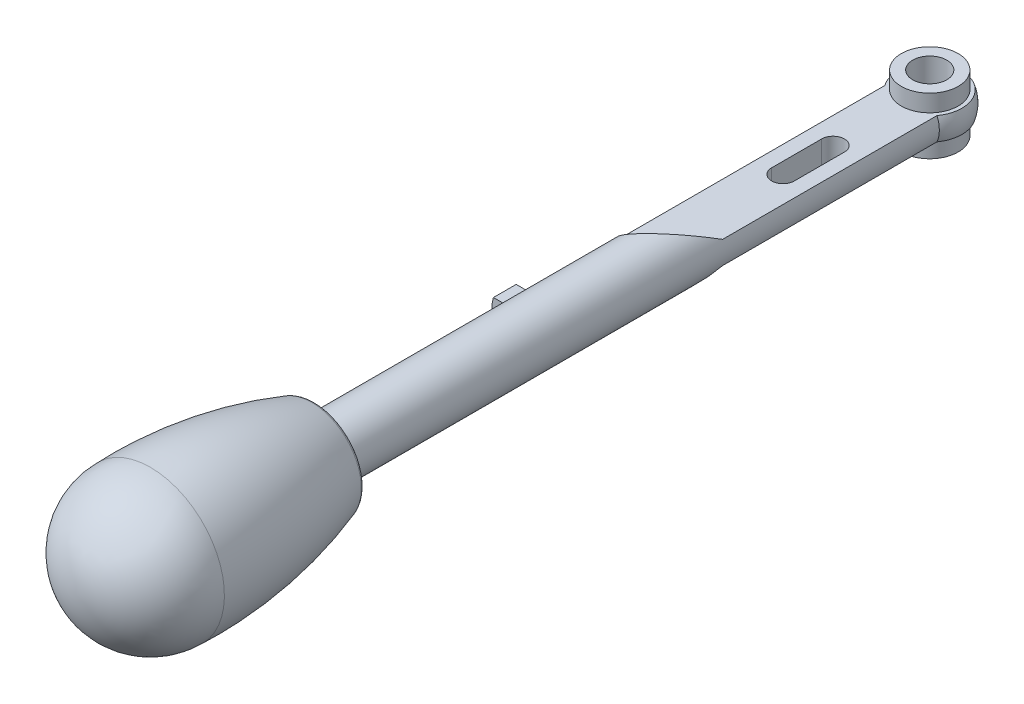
ISO-10303-21;
HEADER;
FILE_DESCRIPTION(('STEP AP214'),'2;1');
FILE_NAME('part.step','',(''),(''),'','','');
FILE_SCHEMA(('AUTOMOTIVE_DESIGN { 1 0 10303 214 1 1 1 1 }'));
ENDSEC;
DATA;
#1=APPLICATION_CONTEXT('core data for automotive mechanical design processes');
#2=APPLICATION_PROTOCOL_DEFINITION('international standard','automotive_design',2000,#1);
#3=PRODUCT_CONTEXT('',#1,'mechanical');
#4=PRODUCT('Part','Part','',(#3));
#5=PRODUCT_RELATED_PRODUCT_CATEGORY('part','',(#4));
#6=PRODUCT_DEFINITION_FORMATION('','',#4);
#7=PRODUCT_DEFINITION_CONTEXT('part definition',#1,'design');
#8=PRODUCT_DEFINITION('design','',#6,#7);
#9=PRODUCT_DEFINITION_SHAPE('','',#8);
#10=(LENGTH_UNIT() NAMED_UNIT(*) SI_UNIT(.MILLI.,.METRE.));
#11=(NAMED_UNIT(*) PLANE_ANGLE_UNIT() SI_UNIT($,.RADIAN.));
#12=(NAMED_UNIT(*) SI_UNIT($,.STERADIAN.) SOLID_ANGLE_UNIT());
#13=UNCERTAINTY_MEASURE_WITH_UNIT(LENGTH_MEASURE(1.E-05),#10,'distance_accuracy_value','');
#14=(GEOMETRIC_REPRESENTATION_CONTEXT(3) GLOBAL_UNCERTAINTY_ASSIGNED_CONTEXT((#13)) GLOBAL_UNIT_ASSIGNED_CONTEXT((#10,
#11,#12)) REPRESENTATION_CONTEXT('',''));
#15=CARTESIAN_POINT('',(0.,0.,0.));
#16=DIRECTION('',(0.,0.,1.));
#17=DIRECTION('',(1.,0.,0.));
#18=AXIS2_PLACEMENT_3D('',#15,#16,#17);
#19=CARTESIAN_POINT('',(0.,-5.,0.));
#20=DIRECTION('',(0.,1.,0.));
#21=DIRECTION('',(0.267643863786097,0.,-0.96351790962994));
#22=AXIS2_PLACEMENT_3D('',#19,#20,#21);
#23=PLANE('',#22);
#24=CARTESIAN_POINT('',(0.,-5.,0.));
#25=DIRECTION('',(0.,1.,0.));
#26=DIRECTION('',(0.267643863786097,0.,-0.96351790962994));
#27=AXIS2_PLACEMENT_3D('',#24,#25,#26);
#28=CIRCLE('',#27,5.);
#29=CARTESIAN_POINT('',(1.33821931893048,-5.,-4.8175895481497));
#30=VERTEX_POINT('',#29);
#31=EDGE_CURVE('E24',#30,#30,#28,.T.);
#32=ORIENTED_EDGE('',*,*,#31,.F.);
#33=EDGE_LOOP('',(#32));
#34=FACE_BOUND('',#33,.T.);
#35=CARTESIAN_POINT('',(0.,-5.,0.));
#36=DIRECTION('',(0.,1.,0.));
#37=DIRECTION('',(-0.267643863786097,0.,0.96351790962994));
#38=AXIS2_PLACEMENT_3D('',#35,#36,#37);
#39=CIRCLE('',#38,3.);
#40=CARTESIAN_POINT('',(-0.802931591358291,-5.,2.89055372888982));
#41=VERTEX_POINT('',#40);
#42=EDGE_CURVE('E155',#41,#41,#39,.F.);
#43=ORIENTED_EDGE('',*,*,#42,.F.);
#44=EDGE_LOOP('',(#43));
#45=FACE_BOUND('',#44,.T.);
#46=ADVANCED_FACE('F14',(#34,#45),#23,.F.);
#47=CARTESIAN_POINT('',(0.,-2.,0.));
#48=DIRECTION('',(0.,-1.,0.));
#49=DIRECTION('',(-0.267643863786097,0.,0.96351790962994));
#50=AXIS2_PLACEMENT_3D('',#47,#48,#49);
#51=CYLINDRICAL_SURFACE('',#50,5.);
#52=CARTESIAN_POINT('',(0.,-2.,0.));
#53=DIRECTION('',(0.,1.,0.));
#54=DIRECTION('',(0.267643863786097,0.,-0.96351790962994));
#55=AXIS2_PLACEMENT_3D('',#52,#53,#54);
#56=CIRCLE('',#55,5.);
#57=CARTESIAN_POINT('',(1.33821931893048,-2.,-4.8175895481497));
#58=VERTEX_POINT('',#57);
#59=EDGE_CURVE('E9',#58,#58,#56,.T.);
#60=ORIENTED_EDGE('',*,*,#59,.F.);
#61=EDGE_LOOP('',(#60));
#62=FACE_BOUND('',#61,.T.);
#63=ORIENTED_EDGE('',*,*,#31,.T.);
#64=EDGE_LOOP('',(#63));
#65=FACE_BOUND('',#64,.T.);
#66=ADVANCED_FACE('F281',(#62,#65),#51,.T.);
#67=CARTESIAN_POINT('',(0.,0.,137.));
#68=DIRECTION('',(0.,1.,0.));
#69=DIRECTION('',(0.,0.,1.));
#70=AXIS2_PLACEMENT_3D('',#67,#68,#69);
#71=SPHERICAL_SURFACE('',#70,13.);
#72=CARTESIAN_POINT('',(0.,0.,137.));
#73=DIRECTION('',(0.,0.,-1.));
#74=DIRECTION('',(0.,1.,0.));
#75=AXIS2_PLACEMENT_3D('',#72,#73,#74);
#76=SPHERICAL_SURFACE('',#75,13.);
#77=CARTESIAN_POINT('',(0.,0.,137.));
#78=DIRECTION('',(0.,0.,-1.));
#79=DIRECTION('',(0.,1.,0.));
#80=AXIS2_PLACEMENT_3D('',#77,#78,#79);
#81=CIRCLE('',#80,13.);
#82=CARTESIAN_POINT('',(0.,13.,137.));
#83=VERTEX_POINT('',#82);
#84=EDGE_CURVE('E332',#83,#83,#81,.T.);
#85=ORIENTED_EDGE('',*,*,#84,.F.);
#86=EDGE_LOOP('',(#85));
#87=FACE_BOUND('',#86,.T.);
#88=ADVANCED_FACE('F288',(#87),#76,.T.);
#89=CARTESIAN_POINT('',(0.,0.,134.558874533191));
#90=DIRECTION('',(0.,0.,-1.));
#91=DIRECTION('',(0.,1.,0.));
#92=AXIS2_PLACEMENT_3D('',#89,#90,#91);
#93=DEGENERATE_TOROIDAL_SURFACE('',#92,66.9627469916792,80.,.F.);
#94=CARTESIAN_POINT('',(0.,0.,108.676469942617));
#95=DIRECTION('',(0.,0.,-1.));
#96=DIRECTION('',(0.,1.,0.));
#97=AXIS2_PLACEMENT_3D('',#94,#95,#96);
#98=CIRCLE('',#97,8.73468448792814);
#99=CARTESIAN_POINT('',(0.,8.73468448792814,108.676469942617));
#100=VERTEX_POINT('',#99);
#101=EDGE_CURVE('E148',#100,#100,#98,.T.);
#102=ORIENTED_EDGE('',*,*,#101,.F.);
#103=EDGE_LOOP('',(#102));
#104=FACE_BOUND('',#103,.T.);
#105=ORIENTED_EDGE('',*,*,#84,.T.);
#106=EDGE_LOOP('',(#105));
#107=FACE_BOUND('',#106,.T.);
#108=ADVANCED_FACE('F301',(#104,#107),#93,.F.);
#109=CARTESIAN_POINT('',(0.,0.,109.));
#110=DIRECTION('',(0.,0.,-1.));
#111=DIRECTION('',(0.,1.,0.));
#112=AXIS2_PLACEMENT_3D('',#109,#110,#111);
#113=TOROIDAL_SURFACE('',#112,7.78846659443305,1.);
#114=CARTESIAN_POINT('',(0.,0.,108.));
#115=DIRECTION('',(0.,0.,-1.));
#116=DIRECTION('',(0.,1.,0.));
#117=AXIS2_PLACEMENT_3D('',#114,#115,#116);
#118=CIRCLE('',#117,7.78846659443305);
#119=CARTESIAN_POINT('',(0.,7.78846659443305,108.));
#120=VERTEX_POINT('',#119);
#121=EDGE_CURVE('E329',#120,#120,#118,.T.);
#122=ORIENTED_EDGE('',*,*,#121,.F.);
#123=EDGE_LOOP('',(#122));
#124=FACE_BOUND('',#123,.T.);
#125=ORIENTED_EDGE('',*,*,#101,.T.);
#126=EDGE_LOOP('',(#125));
#127=FACE_BOUND('',#126,.T.);
#128=ADVANCED_FACE('F299',(#124,#127),#113,.T.);
#129=CARTESIAN_POINT('',(0.,5.,0.));
#130=DIRECTION('',(0.,1.,0.));
#131=DIRECTION('',(0.267643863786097,0.,-0.96351790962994));
#132=AXIS2_PLACEMENT_3D('',#129,#130,#131);
#133=PLANE('',#132);
#134=CARTESIAN_POINT('',(0.,5.,0.));
#135=DIRECTION('',(0.,1.,0.));
#136=DIRECTION('',(0.267643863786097,0.,-0.96351790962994));
#137=AXIS2_PLACEMENT_3D('',#134,#135,#136);
#138=CIRCLE('',#137,5.);
#139=CARTESIAN_POINT('',(1.33821931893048,5.,-4.8175895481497));
#140=VERTEX_POINT('',#139);
#141=EDGE_CURVE('E340',#140,#140,#138,.T.);
#142=ORIENTED_EDGE('',*,*,#141,.T.);
#143=EDGE_LOOP('',(#142));
#144=FACE_BOUND('',#143,.T.);
#145=CARTESIAN_POINT('',(0.,5.,0.));
#146=DIRECTION('',(0.,1.,0.));
#147=DIRECTION('',(-0.267643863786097,0.,0.96351790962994));
#148=AXIS2_PLACEMENT_3D('',#145,#146,#147);
#149=CIRCLE('',#148,3.);
#150=CARTESIAN_POINT('',(-0.802931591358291,5.,2.89055372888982));
#151=VERTEX_POINT('',#150);
#152=EDGE_CURVE('E347',#151,#151,#149,.T.);
#153=ORIENTED_EDGE('',*,*,#152,.F.);
#154=EDGE_LOOP('',(#153));
#155=FACE_BOUND('',#154,.T.);
#156=ADVANCED_FACE('F295',(#144,#155),#133,.T.);
#157=CARTESIAN_POINT('',(7.788466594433,0.,108.));
#158=DIRECTION('',(0.,0.,1.));
#159=DIRECTION('',(0.,-1.,0.));
#160=AXIS2_PLACEMENT_3D('',#157,#158,#159);
#161=PLANE('',#160);
#162=ORIENTED_EDGE('',*,*,#121,.T.);
#163=EDGE_LOOP('',(#162));
#164=FACE_BOUND('',#163,.T.);
#165=CARTESIAN_POINT('',(0.,0.,108.));
#166=DIRECTION('',(0.,0.,-1.));
#167=DIRECTION('',(0.,-1.,0.));
#168=AXIS2_PLACEMENT_3D('',#165,#166,#167);
#169=CIRCLE('',#168,5.);
#170=CARTESIAN_POINT('',(0.,-5.,108.));
#171=VERTEX_POINT('',#170);
#172=EDGE_CURVE('E144',#171,#171,#169,.T.);
#173=ORIENTED_EDGE('',*,*,#172,.F.);
#174=EDGE_LOOP('',(#173));
#175=FACE_BOUND('',#174,.T.);
#176=ADVANCED_FACE('F298',(#164,#175),#161,.F.);
#177=CARTESIAN_POINT('',(-7.,5.,85.));
#178=DIRECTION('',(0.,0.,-1.));
#179=DIRECTION('',(0.,-1.,0.));
#180=AXIS2_PLACEMENT_3D('',#177,#178,#179);
#181=PLANE('',#180);
#182=DIRECTION('',(0.,-1.,0.));
#183=VECTOR('',#182,1.);
#184=CARTESIAN_POINT('',(-4.,5.,85.));
#185=LINE('',#184,#183);
#186=CARTESIAN_POINT('',(-4.,3.,85.));
#187=VERTEX_POINT('',#186);
#188=CARTESIAN_POINT('',(-4.,-3.,85.));
#189=VERTEX_POINT('',#188);
#190=EDGE_CURVE('E131',#187,#189,#185,.T.);
#191=ORIENTED_EDGE('',*,*,#190,.F.);
#192=CARTESIAN_POINT('',(0.,0.,85.));
#193=DIRECTION('',(0.,0.,-1.));
#194=DIRECTION('',(0.,-1.,0.));
#195=AXIS2_PLACEMENT_3D('',#192,#193,#194);
#196=CIRCLE('',#195,5.);
#197=EDGE_CURVE('E136',#189,#187,#196,.T.);
#198=ORIENTED_EDGE('',*,*,#197,.F.);
#199=EDGE_LOOP('',(#191,#198));
#200=FACE_BOUND('',#199,.T.);
#201=ADVANCED_FACE('F270',(#200),#181,.F.);
#202=CARTESIAN_POINT('',(-4.,5.,85.));
#203=DIRECTION('',(1.,0.,0.));
#204=DIRECTION('',(0.,0.,1.));
#205=AXIS2_PLACEMENT_3D('',#202,#203,#204);
#206=PLANE('',#205);
#207=DIRECTION('',(0.,-1.,0.));
#208=VECTOR('',#207,1.);
#209=CARTESIAN_POINT('',(-4.,5.,93.));
#210=LINE('',#209,#208);
#211=CARTESIAN_POINT('',(-4.,3.,93.));
#212=VERTEX_POINT('',#211);
#213=CARTESIAN_POINT('',(-4.,-3.,93.));
#214=VERTEX_POINT('',#213);
#215=EDGE_CURVE('E124',#212,#214,#210,.T.);
#216=ORIENTED_EDGE('',*,*,#215,.F.);
#217=DIRECTION('',(0.,0.,-1.));
#218=VECTOR('',#217,1.);
#219=CARTESIAN_POINT('',(-4.,3.,70.));
#220=LINE('',#219,#218);
#221=EDGE_CURVE('E116',#187,#212,#220,.F.);
#222=ORIENTED_EDGE('',*,*,#221,.F.);
#223=ORIENTED_EDGE('',*,*,#190,.T.);
#224=DIRECTION('',(0.,0.,-1.));
#225=VECTOR('',#224,1.);
#226=CARTESIAN_POINT('',(-4.,-3.,70.));
#227=LINE('',#226,#225);
#228=EDGE_CURVE('E128',#214,#189,#227,.T.);
#229=ORIENTED_EDGE('',*,*,#228,.F.);
#230=EDGE_LOOP('',(#216,#222,#223,#229));
#231=FACE_BOUND('',#230,.T.);
#232=ADVANCED_FACE('F126',(#231),#206,.F.);
#233=CARTESIAN_POINT('',(-7.,5.,93.));
#234=DIRECTION('',(0.,0.,1.));
#235=DIRECTION('',(0.,1.,0.));
#236=AXIS2_PLACEMENT_3D('',#233,#234,#235);
#237=PLANE('',#236);
#238=ORIENTED_EDGE('',*,*,#215,.T.);
#239=CARTESIAN_POINT('',(0.,0.,93.));
#240=DIRECTION('',(0.,0.,1.));
#241=DIRECTION('',(0.,1.,0.));
#242=AXIS2_PLACEMENT_3D('',#239,#240,#241);
#243=CIRCLE('',#242,5.);
#244=EDGE_CURVE('E133',#212,#214,#243,.T.);
#245=ORIENTED_EDGE('',*,*,#244,.F.);
#246=EDGE_LOOP('',(#238,#245));
#247=FACE_BOUND('',#246,.T.);
#248=ADVANCED_FACE('F134',(#247),#237,.F.);
#249=CARTESIAN_POINT('',(0.,0.,70.));
#250=DIRECTION('',(0.,0.,1.));
#251=DIRECTION('',(0.,1.,0.));
#252=AXIS2_PLACEMENT_3D('',#249,#250,#251);
#253=PLANE('',#252);
#254=DIRECTION('',(-1.,0.,0.));
#255=VECTOR('',#254,1.);
#256=CARTESIAN_POINT('',(-4.58257569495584,-2.,70.));
#257=LINE('',#256,#255);
#258=CARTESIAN_POINT('',(-4.58257569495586,-2.,70.));
#259=VERTEX_POINT('',#258);
#260=CARTESIAN_POINT('',(-6.70820393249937,-2.,70.));
#261=VERTEX_POINT('',#260);
#262=EDGE_CURVE('E163',#259,#261,#257,.T.);
#263=ORIENTED_EDGE('',*,*,#262,.F.);
#264=CARTESIAN_POINT('',(0.,0.,70.));
#265=DIRECTION('',(0.,0.,-1.));
#266=DIRECTION('',(0.,-1.,0.));
#267=AXIS2_PLACEMENT_3D('',#264,#265,#266);
#268=CIRCLE('',#267,5.);
#269=CARTESIAN_POINT('',(-4.58257569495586,2.,70.));
#270=VERTEX_POINT('',#269);
#271=EDGE_CURVE('E33',#259,#270,#268,.T.);
#272=ORIENTED_EDGE('',*,*,#271,.T.);
#273=DIRECTION('',(1.,0.,0.));
#274=VECTOR('',#273,1.);
#275=CARTESIAN_POINT('',(-4.58257569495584,2.,70.));
#276=LINE('',#275,#274);
#277=CARTESIAN_POINT('',(-6.70820393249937,2.,70.));
#278=VERTEX_POINT('',#277);
#279=EDGE_CURVE('E157',#278,#270,#276,.T.);
#280=ORIENTED_EDGE('',*,*,#279,.F.);
#281=CARTESIAN_POINT('',(0.,0.,70.));
#282=DIRECTION('',(0.,0.,-1.));
#283=DIRECTION('',(0.,-1.,0.));
#284=AXIS2_PLACEMENT_3D('',#281,#282,#283);
#285=CIRCLE('',#284,7.);
#286=EDGE_CURVE('E170',#261,#278,#285,.T.);
#287=ORIENTED_EDGE('',*,*,#286,.F.);
#288=EDGE_LOOP('',(#263,#272,#280,#287));
#289=FACE_BOUND('',#288,.T.);
#290=ADVANCED_FACE('F16',(#289),#253,.T.);
#291=CARTESIAN_POINT('',(0.,0.,0.));
#292=DIRECTION('',(0.,0.,-1.));
#293=DIRECTION('',(0.,-1.,0.));
#294=AXIS2_PLACEMENT_3D('',#291,#292,#293);
#295=CYLINDRICAL_SURFACE('',#294,7.);
#296=DIRECTION('',(0.,0.,1.));
#297=VECTOR('',#296,1.);
#298=CARTESIAN_POINT('',(-6.70820393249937,2.,60.));
#299=LINE('',#298,#297);
#300=CARTESIAN_POINT('',(-6.70820393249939,2.,66.));
#301=VERTEX_POINT('',#300);
#302=EDGE_CURVE('E158',#301,#278,#299,.T.);
#303=ORIENTED_EDGE('',*,*,#302,.F.);
#304=CARTESIAN_POINT('',(0.,0.,66.));
#305=DIRECTION('',(0.,0.,-1.));
#306=DIRECTION('',(0.,-1.,0.));
#307=AXIS2_PLACEMENT_3D('',#304,#305,#306);
#308=CIRCLE('',#307,7.);
#309=CARTESIAN_POINT('',(-6.70820393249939,-2.,66.));
#310=VERTEX_POINT('',#309);
#311=EDGE_CURVE('E173',#310,#301,#308,.T.);
#312=ORIENTED_EDGE('',*,*,#311,.F.);
#313=DIRECTION('',(0.,0.,1.));
#314=VECTOR('',#313,1.);
#315=CARTESIAN_POINT('',(-6.70820393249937,-2.,60.));
#316=LINE('',#315,#314);
#317=EDGE_CURVE('E164',#310,#261,#316,.T.);
#318=ORIENTED_EDGE('',*,*,#317,.T.);
#319=ORIENTED_EDGE('',*,*,#286,.T.);
#320=EDGE_LOOP('',(#303,#312,#318,#319));
#321=FACE_BOUND('',#320,.T.);
#322=ADVANCED_FACE('F256',(#321),#295,.T.);
#323=CARTESIAN_POINT('',(0.,5.,0.));
#324=DIRECTION('',(0.,-1.,0.));
#325=DIRECTION('',(-0.267643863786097,0.,0.96351790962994));
#326=AXIS2_PLACEMENT_3D('',#323,#324,#325);
#327=CYLINDRICAL_SURFACE('',#326,5.);
#328=ORIENTED_EDGE('',*,*,#141,.F.);
#329=EDGE_LOOP('',(#328));
#330=FACE_BOUND('',#329,.T.);
#331=CARTESIAN_POINT('',(0.,2.,0.));
#332=DIRECTION('',(0.,1.,0.));
#333=DIRECTION('',(0.267643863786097,0.,-0.96351790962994));
#334=AXIS2_PLACEMENT_3D('',#331,#332,#333);
#335=CIRCLE('',#334,5.);
#336=CARTESIAN_POINT('',(1.33821931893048,2.,-4.8175895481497));
#337=VERTEX_POINT('',#336);
#338=EDGE_CURVE('E337',#337,#337,#335,.T.);
#339=ORIENTED_EDGE('',*,*,#338,.T.);
#340=EDGE_LOOP('',(#339));
#341=FACE_BOUND('',#340,.T.);
#342=ADVANCED_FACE('F271',(#330,#341),#327,.T.);
#343=CARTESIAN_POINT('',(-15.2087121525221,2.,60.7912878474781));
#344=DIRECTION('',(0.5,-0.707106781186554,0.499999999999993));
#345=DIRECTION('',(0.81649658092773,0.577350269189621,0.));
#346=AXIS2_PLACEMENT_3D('',#343,#344,#345);
#347=PLANE('',#346);
#348=CARTESIAN_POINT('',(0.,0.,42.7541485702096));
#349=DIRECTION('',(0.5,-0.707106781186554,0.499999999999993));
#350=DIRECTION('',(0.288675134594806,-0.408248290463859,-0.866025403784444));
#351=AXIS2_PLACEMENT_3D('',#348,#349,#350);
#352=ELLIPSE('',#351,10.0000000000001,5.);
#353=CARTESIAN_POINT('',(-4.58257569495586,2.,50.1651513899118));
#354=VERTEX_POINT('',#353);
#355=CARTESIAN_POINT('',(4.58257569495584,2.,41.));
#356=VERTEX_POINT('',#355);
#357=EDGE_CURVE('E185',#354,#356,#352,.F.);
#358=ORIENTED_EDGE('',*,*,#357,.T.);
#359=DIRECTION('',(0.707106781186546,0.,-0.70710678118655));
#360=VECTOR('',#359,1.);
#361=CARTESIAN_POINT('',(4.58257569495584,2.,41.));
#362=LINE('',#361,#360);
#363=EDGE_CURVE('E187',#354,#356,#362,.T.);
#364=ORIENTED_EDGE('',*,*,#363,.F.);
#365=EDGE_LOOP('',(#358,#364));
#366=FACE_BOUND('',#365,.T.);
#367=ADVANCED_FACE('F261',(#366),#347,.F.);
#368=CARTESIAN_POINT('',(-4.58257569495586,-2.,60.));
#369=DIRECTION('',(0.,1.,0.));
#370=DIRECTION('',(-1.,0.,0.));
#371=AXIS2_PLACEMENT_3D('',#368,#369,#370);
#372=PLANE('',#371);
#373=DIRECTION('',(1.,0.,0.));
#374=VECTOR('',#373,1.);
#375=CARTESIAN_POINT('',(-3.53553390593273,-2.,66.));
#376=LINE('',#375,#374);
#377=CARTESIAN_POINT('',(-4.58257569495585,-2.,66.));
#378=VERTEX_POINT('',#377);
#379=EDGE_CURVE('E167',#310,#378,#376,.T.);
#380=ORIENTED_EDGE('',*,*,#379,.T.);
#381=DIRECTION('',(0.,0.,1.));
#382=VECTOR('',#381,1.);
#383=CARTESIAN_POINT('',(-4.58257569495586,-2.,60.));
#384=LINE('',#383,#382);
#385=EDGE_CURVE('E168',#378,#259,#384,.T.);
#386=ORIENTED_EDGE('',*,*,#385,.T.);
#387=ORIENTED_EDGE('',*,*,#262,.T.);
#388=ORIENTED_EDGE('',*,*,#317,.F.);
#389=EDGE_LOOP('',(#380,#386,#387,#388));
#390=FACE_BOUND('',#389,.T.);
#391=ADVANCED_FACE('F259',(#390),#372,.F.);
#392=CARTESIAN_POINT('',(0.,0.,70.));
#393=DIRECTION('',(0.,0.,-1.));
#394=DIRECTION('',(0.,-1.,0.));
#395=AXIS2_PLACEMENT_3D('',#392,#393,#394);
#396=CYLINDRICAL_SURFACE('',#395,5.);
#397=ORIENTED_EDGE('',*,*,#244,.T.);
#398=ORIENTED_EDGE('',*,*,#228,.T.);
#399=ORIENTED_EDGE('',*,*,#197,.T.);
#400=ORIENTED_EDGE('',*,*,#221,.T.);
#401=EDGE_LOOP('',(#397,#398,#399,#400));
#402=FACE_BOUND('',#401,.T.);
#403=ORIENTED_EDGE('',*,*,#271,.F.);
#404=ORIENTED_EDGE('',*,*,#385,.F.);
#405=CARTESIAN_POINT('',(0.,0.,66.));
#406=DIRECTION('',(0.,0.,-1.));
#407=DIRECTION('',(0.,-1.,0.));
#408=AXIS2_PLACEMENT_3D('',#405,#406,#407);
#409=CIRCLE('',#408,5.);
#410=CARTESIAN_POINT('',(-4.58257569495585,2.,66.));
#411=VERTEX_POINT('',#410);
#412=EDGE_CURVE('E176',#378,#411,#409,.T.);
#413=ORIENTED_EDGE('',*,*,#412,.T.);
#414=DIRECTION('',(0.,0.,1.));
#415=VECTOR('',#414,1.);
#416=CARTESIAN_POINT('',(-4.58257569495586,2.,60.));
#417=LINE('',#416,#415);
#418=EDGE_CURVE('E160',#411,#270,#417,.T.);
#419=ORIENTED_EDGE('',*,*,#418,.T.);
#420=EDGE_LOOP('',(#403,#404,#413,#419));
#421=FACE_BOUND('',#420,.T.);
#422=ORIENTED_EDGE('',*,*,#172,.T.);
#423=EDGE_LOOP('',(#422));
#424=FACE_BOUND('',#423,.T.);
#425=DIRECTION('',(0.,0.,-1.));
#426=VECTOR('',#425,1.);
#427=CARTESIAN_POINT('',(4.58257569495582,-2.,0.));
#428=LINE('',#427,#426);
#429=CARTESIAN_POINT('',(4.58257569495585,-2.,3.31662479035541));
#430=VERTEX_POINT('',#429);
#431=CARTESIAN_POINT('',(4.5825756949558,-2.,41.));
#432=VERTEX_POINT('',#431);
#433=EDGE_CURVE('E216',#430,#432,#428,.F.);
#434=ORIENTED_EDGE('',*,*,#433,.F.);
#435=CARTESIAN_POINT('',(0.,0.,3.31662479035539));
#436=DIRECTION('',(0.,0.,-1.));
#437=DIRECTION('',(0.,-1.,0.));
#438=AXIS2_PLACEMENT_3D('',#435,#436,#437);
#439=CIRCLE('',#438,5.);
#440=CARTESIAN_POINT('',(4.58257569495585,2.,3.31662479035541));
#441=VERTEX_POINT('',#440);
#442=EDGE_CURVE('E210',#441,#430,#439,.T.);
#443=ORIENTED_EDGE('',*,*,#442,.F.);
#444=DIRECTION('',(0.,0.,-1.));
#445=VECTOR('',#444,1.);
#446=CARTESIAN_POINT('',(4.58257569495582,2.,0.));
#447=LINE('',#446,#445);
#448=EDGE_CURVE('E218',#356,#441,#447,.T.);
#449=ORIENTED_EDGE('',*,*,#448,.F.);
#450=ORIENTED_EDGE('',*,*,#357,.F.);
#451=DIRECTION('',(0.,0.,-1.));
#452=VECTOR('',#451,1.);
#453=CARTESIAN_POINT('',(-4.58257569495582,2.,0.));
#454=LINE('',#453,#452);
#455=CARTESIAN_POINT('',(-4.58257569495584,2.,3.31662479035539));
#456=VERTEX_POINT('',#455);
#457=EDGE_CURVE('E220',#456,#354,#454,.F.);
#458=ORIENTED_EDGE('',*,*,#457,.F.);
#459=CARTESIAN_POINT('',(-4.58257569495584,-2.,3.31662479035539));
#460=VERTEX_POINT('',#459);
#461=EDGE_CURVE('E211',#460,#456,#439,.T.);
#462=ORIENTED_EDGE('',*,*,#461,.F.);
#463=DIRECTION('',(0.,0.,-1.));
#464=VECTOR('',#463,1.);
#465=CARTESIAN_POINT('',(-4.58257569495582,-2.,0.));
#466=LINE('',#465,#464);
#467=CARTESIAN_POINT('',(-4.58257569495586,-2.,50.1651513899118));
#468=VERTEX_POINT('',#467);
#469=EDGE_CURVE('E214',#468,#460,#466,.T.);
#470=ORIENTED_EDGE('',*,*,#469,.F.);
#471=CARTESIAN_POINT('',(0.,0.,42.7541485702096));
#472=DIRECTION('',(-0.5,-0.707106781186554,-0.499999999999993));
#473=DIRECTION('',(0.288675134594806,0.408248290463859,-0.866025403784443));
#474=AXIS2_PLACEMENT_3D('',#471,#472,#473);
#475=ELLIPSE('',#474,10.0000000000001,5.);
#476=EDGE_CURVE('E179',#468,#432,#475,.F.);
#477=ORIENTED_EDGE('',*,*,#476,.T.);
#478=EDGE_LOOP('',(#434,#443,#449,#450,#458,#462,#470,#477));
#479=FACE_BOUND('',#478,.T.);
#480=ADVANCED_FACE('F139',(#402,#421,#424,#479),#396,.T.);
#481=CARTESIAN_POINT('',(-4.58257569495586,2.,60.));
#482=DIRECTION('',(0.,-1.,0.));
#483=DIRECTION('',(1.,0.,0.));
#484=AXIS2_PLACEMENT_3D('',#481,#482,#483);
#485=PLANE('',#484);
#486=DIRECTION('',(-1.,0.,0.));
#487=VECTOR('',#486,1.);
#488=CARTESIAN_POINT('',(-3.53553390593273,2.,66.));
#489=LINE('',#488,#487);
#490=EDGE_CURVE('E161',#411,#301,#489,.T.);
#491=ORIENTED_EDGE('',*,*,#490,.T.);
#492=ORIENTED_EDGE('',*,*,#302,.T.);
#493=ORIENTED_EDGE('',*,*,#279,.T.);
#494=ORIENTED_EDGE('',*,*,#418,.F.);
#495=EDGE_LOOP('',(#491,#492,#493,#494));
#496=FACE_BOUND('',#495,.T.);
#497=ADVANCED_FACE('F249',(#496),#485,.F.);
#498=CARTESIAN_POINT('',(-3.53553390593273,-3.53553390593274,66.));
#499=DIRECTION('',(0.,0.,-1.));
#500=DIRECTION('',(0.,-1.,0.));
#501=AXIS2_PLACEMENT_3D('',#498,#499,#500);
#502=PLANE('',#501);
#503=ORIENTED_EDGE('',*,*,#490,.F.);
#504=ORIENTED_EDGE('',*,*,#412,.F.);
#505=ORIENTED_EDGE('',*,*,#379,.F.);
#506=ORIENTED_EDGE('',*,*,#311,.T.);
#507=EDGE_LOOP('',(#503,#504,#505,#506));
#508=FACE_BOUND('',#507,.T.);
#509=ADVANCED_FACE('F252',(#508),#502,.T.);
#510=CARTESIAN_POINT('',(10.,2.,30.));
#511=DIRECTION('',(0.,-1.,0.));
#512=DIRECTION('',(0.,0.,1.));
#513=AXIS2_PLACEMENT_3D('',#510,#511,#512);
#514=PLANE('',#513);
#515=CARTESIAN_POINT('',(0.,2.,0.));
#516=DIRECTION('',(0.,-1.,0.));
#517=DIRECTION('',(0.,0.,1.));
#518=AXIS2_PLACEMENT_3D('',#515,#516,#517);
#519=CIRCLE('',#518,5.65685424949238);
#520=EDGE_CURVE('E152',#441,#456,#519,.F.);
#521=ORIENTED_EDGE('',*,*,#520,.T.);
#522=ORIENTED_EDGE('',*,*,#457,.T.);
#523=ORIENTED_EDGE('',*,*,#363,.T.);
#524=ORIENTED_EDGE('',*,*,#448,.T.);
#525=EDGE_LOOP('',(#521,#522,#523,#524));
#526=FACE_BOUND('',#525,.T.);
#527=DIRECTION('',(0.,0.,-1.));
#528=VECTOR('',#527,1.);
#529=CARTESIAN_POINT('',(-2.00000000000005,2.,30.));
#530=LINE('',#529,#528);
#531=CARTESIAN_POINT('',(-2.00000000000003,2.,25.8));
#532=VERTEX_POINT('',#531);
#533=CARTESIAN_POINT('',(-2.00000000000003,2.,17.));
#534=VERTEX_POINT('',#533);
#535=EDGE_CURVE('E222',#532,#534,#530,.T.);
#536=ORIENTED_EDGE('',*,*,#535,.T.);
#537=CARTESIAN_POINT('',(0.,2.,17.));
#538=DIRECTION('',(0.,-1.,0.));
#539=DIRECTION('',(0.,0.,1.));
#540=AXIS2_PLACEMENT_3D('',#537,#538,#539);
#541=CIRCLE('',#540,2.);
#542=CARTESIAN_POINT('',(1.99999999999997,2.,17.));
#543=VERTEX_POINT('',#542);
#544=EDGE_CURVE('E231',#534,#543,#541,.T.);
#545=ORIENTED_EDGE('',*,*,#544,.T.);
#546=DIRECTION('',(0.,0.,1.));
#547=VECTOR('',#546,1.);
#548=CARTESIAN_POINT('',(1.99999999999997,2.,30.));
#549=LINE('',#548,#547);
#550=CARTESIAN_POINT('',(2.,2.,25.8));
#551=VERTEX_POINT('',#550);
#552=EDGE_CURVE('E228',#543,#551,#549,.T.);
#553=ORIENTED_EDGE('',*,*,#552,.T.);
#554=CARTESIAN_POINT('',(0.,2.,25.8));
#555=DIRECTION('',(0.,-1.,0.));
#556=DIRECTION('',(0.,0.,1.));
#557=AXIS2_PLACEMENT_3D('',#554,#555,#556);
#558=CIRCLE('',#557,2.);
#559=EDGE_CURVE('E225',#551,#532,#558,.T.);
#560=ORIENTED_EDGE('',*,*,#559,.T.);
#561=EDGE_LOOP('',(#536,#545,#553,#560));
#562=FACE_BOUND('',#561,.T.);
#563=ORIENTED_EDGE('',*,*,#338,.F.);
#564=EDGE_LOOP('',(#563));
#565=FACE_BOUND('',#564,.T.);
#566=ADVANCED_FACE('F322',(#526,#562,#565),#514,.F.);
#567=CARTESIAN_POINT('',(0.,-10.,25.8));
#568=DIRECTION('',(0.,1.,0.));
#569=DIRECTION('',(-1.,0.,0.));
#570=AXIS2_PLACEMENT_3D('',#567,#568,#569);
#571=CYLINDRICAL_SURFACE('',#570,2.);
#572=DIRECTION('',(0.,1.,0.));
#573=VECTOR('',#572,1.);
#574=CARTESIAN_POINT('',(-2.00000000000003,-10.,25.8));
#575=LINE('',#574,#573);
#576=CARTESIAN_POINT('',(-2.00000000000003,-2.,25.8));
#577=VERTEX_POINT('',#576);
#578=EDGE_CURVE('E107',#577,#532,#575,.T.);
#579=ORIENTED_EDGE('',*,*,#578,.T.);
#580=ORIENTED_EDGE('',*,*,#559,.F.);
#581=DIRECTION('',(0.,1.,0.));
#582=VECTOR('',#581,1.);
#583=CARTESIAN_POINT('',(2.,-10.,25.8));
#584=LINE('',#583,#582);
#585=CARTESIAN_POINT('',(2.,-2.,25.8));
#586=VERTEX_POINT('',#585);
#587=EDGE_CURVE('E194',#586,#551,#584,.T.);
#588=ORIENTED_EDGE('',*,*,#587,.F.);
#589=CARTESIAN_POINT('',(0.,-2.,25.8));
#590=DIRECTION('',(0.,1.,0.));
#591=DIRECTION('',(0.,0.,-1.));
#592=AXIS2_PLACEMENT_3D('',#589,#590,#591);
#593=CIRCLE('',#592,2.);
#594=EDGE_CURVE('E201',#577,#586,#593,.T.);
#595=ORIENTED_EDGE('',*,*,#594,.F.);
#596=EDGE_LOOP('',(#579,#580,#588,#595));
#597=FACE_BOUND('',#596,.T.);
#598=ADVANCED_FACE('F369',(#597),#571,.F.);
#599=CARTESIAN_POINT('',(-2.00000000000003,-10.,25.8));
#600=DIRECTION('',(-1.,0.,0.));
#601=DIRECTION('',(0.,0.,1.));
#602=AXIS2_PLACEMENT_3D('',#599,#600,#601);
#603=PLANE('',#602);
#604=DIRECTION('',(0.,1.,0.));
#605=VECTOR('',#604,1.);
#606=CARTESIAN_POINT('',(-2.00000000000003,-10.,17.));
#607=LINE('',#606,#605);
#608=CARTESIAN_POINT('',(-2.00000000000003,-2.,17.));
#609=VERTEX_POINT('',#608);
#610=EDGE_CURVE('E102',#609,#534,#607,.T.);
#611=ORIENTED_EDGE('',*,*,#610,.T.);
#612=ORIENTED_EDGE('',*,*,#535,.F.);
#613=ORIENTED_EDGE('',*,*,#578,.F.);
#614=DIRECTION('',(0.,0.,1.));
#615=VECTOR('',#614,1.);
#616=CARTESIAN_POINT('',(-2.00000000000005,-2.,30.));
#617=LINE('',#616,#615);
#618=EDGE_CURVE('E193',#609,#577,#617,.T.);
#619=ORIENTED_EDGE('',*,*,#618,.F.);
#620=EDGE_LOOP('',(#611,#612,#613,#619));
#621=FACE_BOUND('',#620,.T.);
#622=ADVANCED_FACE('F274',(#621),#603,.F.);
#623=CARTESIAN_POINT('',(0.,-10.,17.));
#624=DIRECTION('',(0.,1.,0.));
#625=DIRECTION('',(-1.,0.,0.));
#626=AXIS2_PLACEMENT_3D('',#623,#624,#625);
#627=CYLINDRICAL_SURFACE('',#626,2.);
#628=DIRECTION('',(0.,1.,0.));
#629=VECTOR('',#628,1.);
#630=CARTESIAN_POINT('',(1.99999999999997,-10.,17.));
#631=LINE('',#630,#629);
#632=CARTESIAN_POINT('',(1.99999999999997,-2.,17.));
#633=VERTEX_POINT('',#632);
#634=EDGE_CURVE('E190',#633,#543,#631,.T.);
#635=ORIENTED_EDGE('',*,*,#634,.T.);
#636=ORIENTED_EDGE('',*,*,#544,.F.);
#637=ORIENTED_EDGE('',*,*,#610,.F.);
#638=CARTESIAN_POINT('',(0.,-2.,17.));
#639=DIRECTION('',(0.,1.,0.));
#640=DIRECTION('',(0.,0.,-1.));
#641=AXIS2_PLACEMENT_3D('',#638,#639,#640);
#642=CIRCLE('',#641,2.);
#643=EDGE_CURVE('E207',#633,#609,#642,.T.);
#644=ORIENTED_EDGE('',*,*,#643,.F.);
#645=EDGE_LOOP('',(#635,#636,#637,#644));
#646=FACE_BOUND('',#645,.T.);
#647=ADVANCED_FACE('F367',(#646),#627,.F.);
#648=CARTESIAN_POINT('',(1.99999999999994,-10.,25.8));
#649=DIRECTION('',(1.,0.,0.));
#650=DIRECTION('',(0.,0.,-1.));
#651=AXIS2_PLACEMENT_3D('',#648,#649,#650);
#652=PLANE('',#651);
#653=ORIENTED_EDGE('',*,*,#587,.T.);
#654=ORIENTED_EDGE('',*,*,#552,.F.);
#655=ORIENTED_EDGE('',*,*,#634,.F.);
#656=DIRECTION('',(0.,0.,-1.));
#657=VECTOR('',#656,1.);
#658=CARTESIAN_POINT('',(1.99999999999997,-2.,30.));
#659=LINE('',#658,#657);
#660=EDGE_CURVE('E204',#586,#633,#659,.T.);
#661=ORIENTED_EDGE('',*,*,#660,.F.);
#662=EDGE_LOOP('',(#653,#654,#655,#661));
#663=FACE_BOUND('',#662,.T.);
#664=ADVANCED_FACE('F364',(#663),#652,.F.);
#665=CARTESIAN_POINT('',(-15.2087121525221,-2.,60.7912878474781));
#666=DIRECTION('',(-0.5,-0.707106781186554,-0.499999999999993));
#667=DIRECTION('',(0.81649658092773,-0.577350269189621,0.));
#668=AXIS2_PLACEMENT_3D('',#665,#666,#667);
#669=PLANE('',#668);
#670=DIRECTION('',(0.707106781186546,0.,-0.70710678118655));
#671=VECTOR('',#670,1.);
#672=CARTESIAN_POINT('',(4.58257569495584,-2.,41.));
#673=LINE('',#672,#671);
#674=EDGE_CURVE('E182',#468,#432,#673,.T.);
#675=ORIENTED_EDGE('',*,*,#674,.T.);
#676=ORIENTED_EDGE('',*,*,#476,.F.);
#677=EDGE_LOOP('',(#675,#676));
#678=FACE_BOUND('',#677,.T.);
#679=ADVANCED_FACE('F275',(#678),#669,.T.);
#680=CARTESIAN_POINT('',(0.,0.,0.));
#681=DIRECTION('',(0.,0.,-1.));
#682=DIRECTION('',(1.,0.,0.));
#683=AXIS2_PLACEMENT_3D('',#680,#681,#682);
#684=SPHERICAL_SURFACE('',#683,6.);
#685=ORIENTED_EDGE('',*,*,#520,.F.);
#686=ORIENTED_EDGE('',*,*,#442,.T.);
#687=CARTESIAN_POINT('',(0.,-2.,0.));
#688=DIRECTION('',(0.,1.,0.));
#689=DIRECTION('',(-1.,0.,0.));
#690=AXIS2_PLACEMENT_3D('',#687,#688,#689);
#691=CIRCLE('',#690,5.65685424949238);
#692=EDGE_CURVE('E154',#460,#430,#691,.F.);
#693=ORIENTED_EDGE('',*,*,#692,.F.);
#694=ORIENTED_EDGE('',*,*,#461,.T.);
#695=EDGE_LOOP('',(#685,#686,#693,#694));
#696=FACE_BOUND('',#695,.T.);
#697=ADVANCED_FACE('F359',(#696),#684,.T.);
#698=CARTESIAN_POINT('',(10.,-2.,30.));
#699=DIRECTION('',(0.,1.,0.));
#700=DIRECTION('',(0.,0.,-1.));
#701=AXIS2_PLACEMENT_3D('',#698,#699,#700);
#702=PLANE('',#701);
#703=ORIENTED_EDGE('',*,*,#692,.T.);
#704=ORIENTED_EDGE('',*,*,#433,.T.);
#705=ORIENTED_EDGE('',*,*,#674,.F.);
#706=ORIENTED_EDGE('',*,*,#469,.T.);
#707=EDGE_LOOP('',(#703,#704,#705,#706));
#708=FACE_BOUND('',#707,.T.);
#709=ORIENTED_EDGE('',*,*,#660,.T.);
#710=ORIENTED_EDGE('',*,*,#643,.T.);
#711=ORIENTED_EDGE('',*,*,#618,.T.);
#712=ORIENTED_EDGE('',*,*,#594,.T.);
#713=EDGE_LOOP('',(#709,#710,#711,#712));
#714=FACE_BOUND('',#713,.T.);
#715=ORIENTED_EDGE('',*,*,#59,.T.);
#716=EDGE_LOOP('',(#715));
#717=FACE_BOUND('',#716,.T.);
#718=ADVANCED_FACE('F291',(#708,#714,#717),#702,.F.);
#719=CARTESIAN_POINT('',(0.,-5.,0.));
#720=DIRECTION('',(0.,1.,0.));
#721=DIRECTION('',(-1.,0.,0.));
#722=AXIS2_PLACEMENT_3D('',#719,#720,#721);
#723=CYLINDRICAL_SURFACE('',#722,3.);
#724=ORIENTED_EDGE('',*,*,#42,.T.);
#725=EDGE_LOOP('',(#724));
#726=FACE_BOUND('',#725,.T.);
#727=ORIENTED_EDGE('',*,*,#152,.T.);
#728=EDGE_LOOP('',(#727));
#729=FACE_BOUND('',#728,.T.);
#730=ADVANCED_FACE('F305',(#726,#729),#723,.F.);
#731=CLOSED_SHELL('',(#46,#66,#88,#108,#128,#156,#176,#201,#232,#248,#290,#322,#342,#367,#391,
#480,#497,#509,#566,#598,#622,#647,#664,#679,#697,#718,#730));
#732=MANIFOLD_SOLID_BREP('B1',#731);
#733=ADVANCED_BREP_SHAPE_REPRESENTATION('',(#18,#732),#14);
#734=SHAPE_DEFINITION_REPRESENTATION(#9,#733);
ENDSEC;
END-ISO-10303-21;
